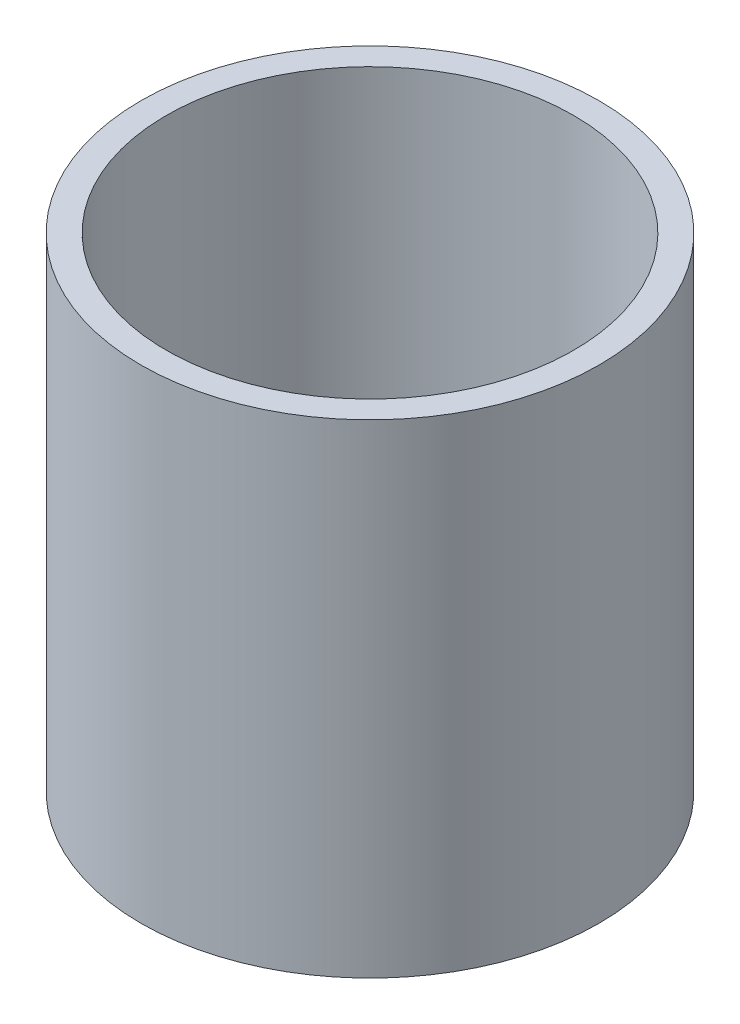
from build123d import *

# Parameters (mm, degrees)
SKETCH1_W = 1.5875
SKETCH1_H = 30.1625


with BuildPart() as part:
    # Sketch1 → Revolve1 (revolve)
    with BuildSketch(Plane.XY, mode=Mode.PRIVATE) as revolve1_sk:
        with Locations((13.49375, 15.08125)):
            Rectangle(SKETCH1_W, SKETCH1_H)
    revolve(revolve1_sk.sketch.rotate(Axis((0, 0, 0), (0, 1, 0)), 90), axis=Axis((0, 0, 0), (0, 1, 0)))


solid = part.part
